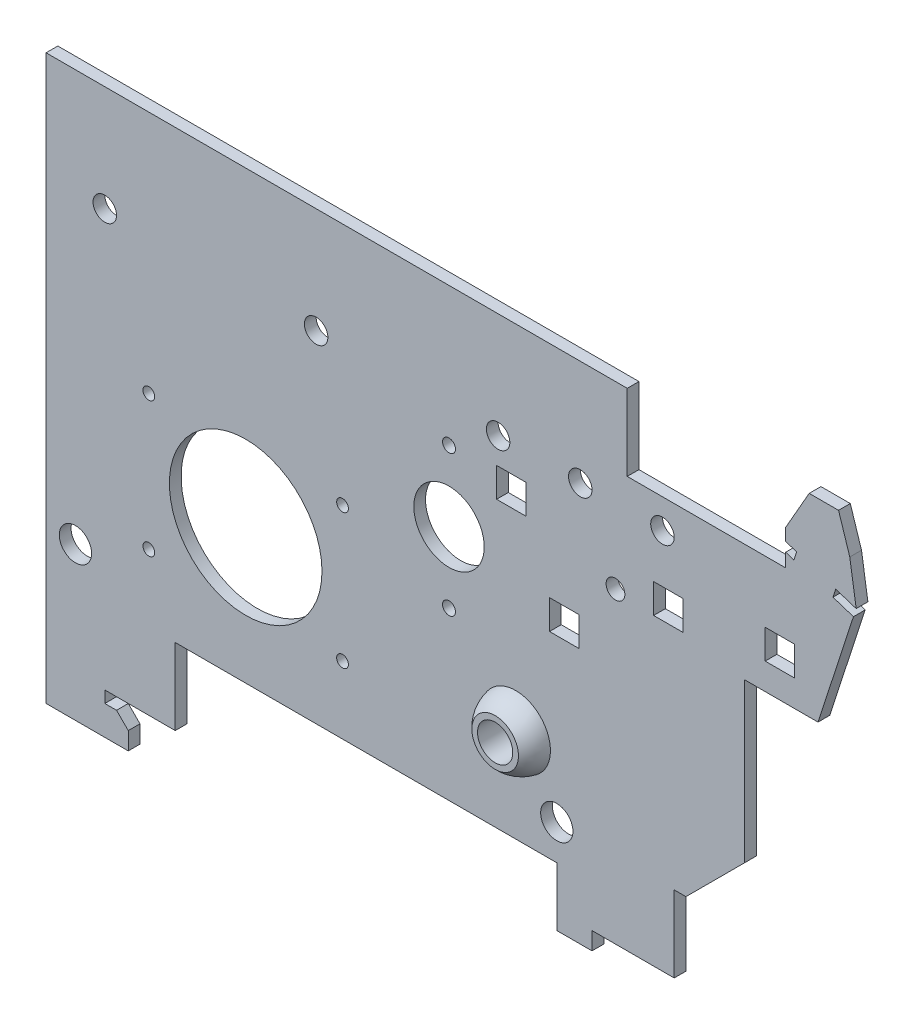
from build123d import *

# Parameters (mm, degrees)
EXTRUSION1_DEPTH             = 1
ENL_V_MAT_EXTRU_2_DEPTH      = 101.004999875
ENL_V_MAT_EXTRU_2_DEPTH_BACK = 101.004999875
ESQUISSE2_R                  = 2.75
ENL_V_MAT_EXTRU_4_DEPTH      = 101.004999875
ENL_V_MAT_EXTRU_4_DEPTH_BACK = 101.004999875
ESQUISSE3_R                  = 13
ENL_V_MAT_EXTRU_5_DEPTH      = 101.179838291
ENL_V_MAT_EXTRU_5_DEPTH_BACK = 101.179838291
ESQUISSE5_W                  = 13.75914837
ESQUISSE5_H                  = 8.286759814
ESQUISSE5_H_2                = 4.846972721
ESQUISSE6_R                  = 3
ENL_V_MAT_EXTRU_6_DEPTH      = 101.40418318
ENL_V_MAT_EXTRU_7_DEPTH      = 101.15113579
CHANFREIN1_SIZE              = 10
ESQUISSE9_R                  = 1.6
ENL_V_MAT_EXTRU_9_DEPTH      = 101.15113579
ESQUISSE11_R                 = 1
ENL_V_MAT_EXTRU_11_DEPTH     = 101.15113579
ESQUISSE12_R                 = 6
ESQUISSE12_W                 = 5
ESQUISSE12_H                 = 5
ENL_V_MAT_EXTRU_12_DEPTH     = 101.15113579
ESQUISSE13_R                 = 1.1
ENL_V_MAT_EXTRU_13_DEPTH     = 101.15113579
ESQUISSE14_R                 = 2
ENL_V_MAT_EXTRU_14_DEPTH     = 101.15113579
CHANFREIN2_SIZE              = 6
CHANFREIN2_SIZE2             = 1


with BuildPart() as part:
    # Esquisse1 → Extrusion1 (new, symmetric)
    with BuildSketch(Plane.XY):
        Polygon((7, -16), (-58, -16), (-58, -29), (-70, -29), (-70, -31), (-68, -31), (-66, -33), (-66, -36), (-80, -36), (-80, 60), (19, 60), (19, 47), (46, 47), (46, 53), (50, 60), (56, 60), (58, 47), (51.5, 27), (39, 27), (39, -10), (27, -10), (27, -23), (13, -23), (13, -26), (7, -26), align=None)
    extrude(amount=EXTRUSION1_DEPTH, both=True)

    # Esquisse2 → Enl_v. mat.-Extru.2 (cut, two sides: drawn at the far end of the back side and taken through both)
    with BuildSketch(Plane.XY.offset(-ENL_V_MAT_EXTRU_2_DEPTH_BACK)):
        with Locations((7, -10)):
            Circle(ESQUISSE2_R)
        with Locations((-75, -10)):
            Circle(ESQUISSE2_R)
    extrude(amount=ENL_V_MAT_EXTRU_2_DEPTH + ENL_V_MAT_EXTRU_2_DEPTH_BACK, mode=Mode.SUBTRACT)

    # Esquisse3 → Enl_v. mat.-Extru.4 (cut, two sides: drawn at the far end of the back side and taken through both)
    with BuildSketch(Plane.XY.offset(-ENL_V_MAT_EXTRU_4_DEPTH_BACK)):
        with Locations((-46, 7)):
            Circle(ESQUISSE3_R)
    extrude(amount=ENL_V_MAT_EXTRU_4_DEPTH + ENL_V_MAT_EXTRU_4_DEPTH_BACK, mode=Mode.SUBTRACT)

    # Esquisse4 → R_volution1 (revolve)
    with BuildSketch(Plane.XY):
        with BuildLine():
            Line((0, -6), (0, 6))
            ThreePointArc((0, 6), (-6, 0), (0, -6))
        make_face()
    revolve(axis=Axis((0, 10.514637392, 0), (0, -1, 0)))

    # Esquisse5 → Enl_v. mat.-Extru.5 (cut, two sides: drawn at the far end of the back side and taken through both)
    with BuildSketch(Plane(origin=(0, 0, 0), x_dir=(1, 0, 0), z_dir=(0, 1, 0)).offset(-ENL_V_MAT_EXTRU_5_DEPTH_BACK)):
        with Locations((0.193945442, 8.643379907)):
            Rectangle(ESQUISSE5_W, ESQUISSE5_H)
        with Locations((0.193945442, -6.923486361)):
            Rectangle(ESQUISSE5_W, ESQUISSE5_H_2)
    extrude(amount=ENL_V_MAT_EXTRU_5_DEPTH + ENL_V_MAT_EXTRU_5_DEPTH_BACK, mode=Mode.SUBTRACT)

    # Esquisse6 → Enl_v. mat.-Extru.6 (cut, through all)
    with BuildSketch(Plane(origin=(0, 0, -4.5), x_dir=(-1, 0, 0), z_dir=(0, 0, -1))):
        Circle(ESQUISSE6_R)
    extrude(amount=-ENL_V_MAT_EXTRU_6_DEPTH, mode=Mode.SUBTRACT)

    # Esquisse7 → Enl_v. mat.-Extru.7 (cut, through all)
    with BuildSketch(Plane(origin=(0, 0, -1), x_dir=(-1, 0, 0), z_dir=(0, 0, -1))):
        Polygon((-46, 50.9), (-46, 49.322769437), (-47.394921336, 48.869420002), (-47.858550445, 50.295971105), align=None)
        Polygon((-58, 47), (-57.536370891, 45.573448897), (-54.052159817, 46.705817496), (-54.515788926, 48.132368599), align=None)
    extrude(amount=-ENL_V_MAT_EXTRU_7_DEPTH, mode=Mode.SUBTRACT)

    # Chanfrein1
    chanfrein1_edges = [part.edges().sort_by_distance(p)[0] for p in [
        (39, -10, 0),
    ]]
    chamfer(chanfrein1_edges, length=CHANFREIN1_SIZE)

    # Esquisse9 → Enl_v. mat.-Extru.9 (cut, through all)
    with BuildSketch(Plane.XY.offset(1)):
        with Locations((17, 29.37)):
            Circle(ESQUISSE9_R)
    extrude(amount=-ENL_V_MAT_EXTRU_9_DEPTH, mode=Mode.SUBTRACT)

    # Esquisse11 → Enl_v. mat.-Extru.11 (cut, through all)
    with BuildSketch(Plane(origin=(0, 0, -1), x_dir=(-1, 0, 0), z_dir=(0, 0, -1))):
        with Locations((29.5, 18.5)):
            Circle(ESQUISSE11_R)
        with Locations((62.5, 18.5)):
            Circle(ESQUISSE11_R)
        with Locations((62.5, -4.5)):
            Circle(ESQUISSE11_R)
        with Locations((29.5, -4.5)):
            Circle(ESQUISSE11_R)
    extrude(amount=-ENL_V_MAT_EXTRU_11_DEPTH, mode=Mode.SUBTRACT)

    # Esquisse12 → Enl_v. mat.-Extru.12 (cut, through all)
    with BuildSketch(Plane.XY.offset(1)):
        with Locations((-11.361774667, 24.393398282)):
            Circle(ESQUISSE12_R)
        with Locations((45, 34)):
            Rectangle(ESQUISSE12_W, ESQUISSE12_H)
        with Locations((8.258705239, 20)):
            Rectangle(ESQUISSE12_W, ESQUISSE12_H)
        with Locations((26, 31.235945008)):
            Rectangle(ESQUISSE12_W, ESQUISSE12_H)
        with Locations((-0.755172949, 35)):
            Rectangle(ESQUISSE12_W, ESQUISSE12_H)
    extrude(amount=-ENL_V_MAT_EXTRU_12_DEPTH, mode=Mode.SUBTRACT)

    # Esquisse13 → Enl_v. mat.-Extru.13 (cut, through all)
    with BuildSketch(Plane.XY.offset(1)):
        with Locations((-11.361774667, 36.393398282)):
            Circle(ESQUISSE13_R)
        with Locations((-11.361774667, 12.393398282)):
            Circle(ESQUISSE13_R)
    extrude(amount=-ENL_V_MAT_EXTRU_13_DEPTH, mode=Mode.SUBTRACT)

    # Esquisse14 → Enl_v. mat.-Extru.14 (cut, through all)
    with BuildSketch(Plane.XY.offset(1)):
        with Locations((-70, 42)):
            Circle(ESQUISSE14_R)
        with Locations((-34, 42)):
            Circle(ESQUISSE14_R)
        with Locations((-3, 42)):
            Circle(ESQUISSE14_R)
        with Locations((11, 42)):
            Circle(ESQUISSE14_R)
        with Locations((25, 42)):
            Circle(ESQUISSE14_R)
    extrude(amount=-ENL_V_MAT_EXTRU_14_DEPTH, mode=Mode.SUBTRACT)

    # Chanfrein2
    chanfrein2_edges = [part.edges().sort_by_distance(p)[0] for p in [
        (56, 60, 0),
    ]]
    chanfrein2_side = [part.faces().sort_by_distance(p)[0] for p in [
        (57, 53.5, 0),
    ]]
    chamfer(chanfrein2_edges, length=CHANFREIN2_SIZE, length2=CHANFREIN2_SIZE2, reference=chanfrein2_side[0])


solid = part.part
